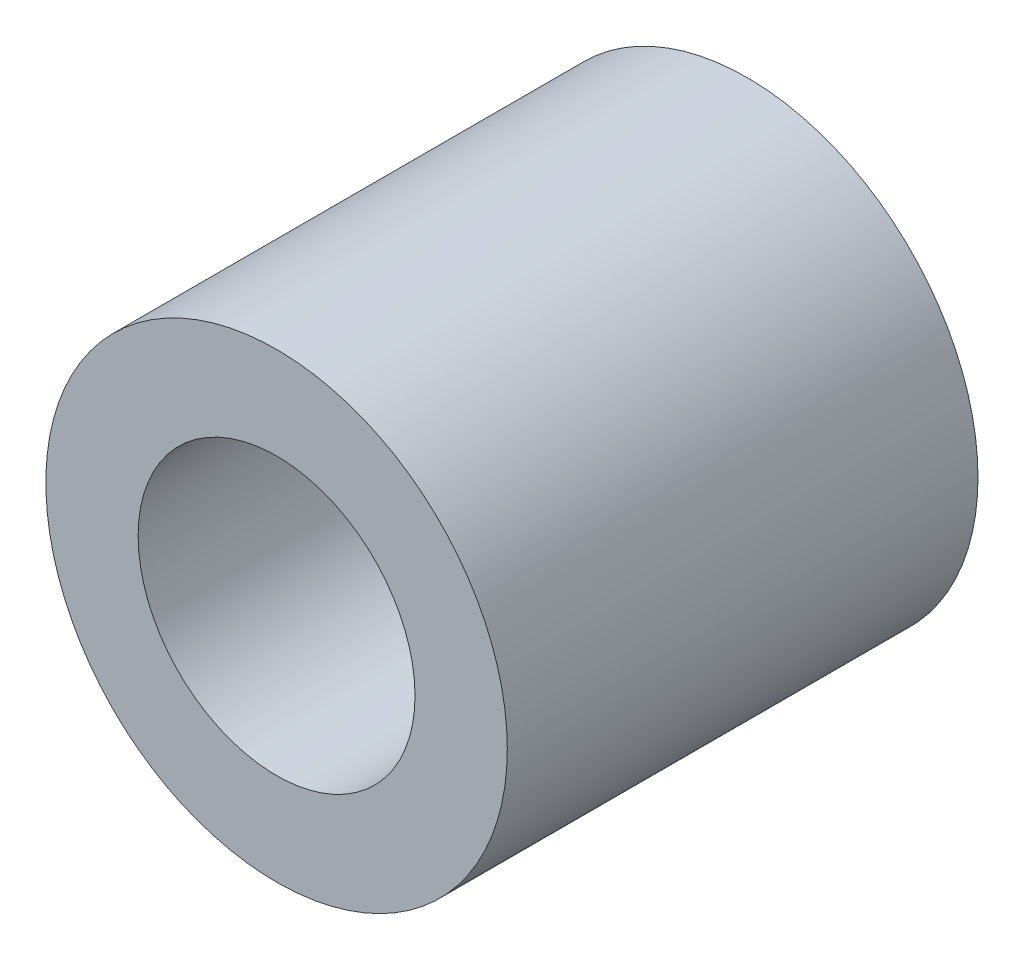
ISO-10303-21;
HEADER;
FILE_DESCRIPTION(('STEP AP214'),'2;1');
FILE_NAME('part.step','',(''),(''),'','','');
FILE_SCHEMA(('AUTOMOTIVE_DESIGN { 1 0 10303 214 1 1 1 1 }'));
ENDSEC;
DATA;
#1=APPLICATION_CONTEXT('core data for automotive mechanical design processes');
#2=APPLICATION_PROTOCOL_DEFINITION('international standard','automotive_design',2000,#1);
#3=PRODUCT_CONTEXT('',#1,'mechanical');
#4=PRODUCT('Part','Part','',(#3));
#5=PRODUCT_RELATED_PRODUCT_CATEGORY('part','',(#4));
#6=PRODUCT_DEFINITION_FORMATION('','',#4);
#7=PRODUCT_DEFINITION_CONTEXT('part definition',#1,'design');
#8=PRODUCT_DEFINITION('design','',#6,#7);
#9=PRODUCT_DEFINITION_SHAPE('','',#8);
#10=(LENGTH_UNIT() NAMED_UNIT(*) SI_UNIT(.MILLI.,.METRE.));
#11=(NAMED_UNIT(*) PLANE_ANGLE_UNIT() SI_UNIT($,.RADIAN.));
#12=(NAMED_UNIT(*) SI_UNIT($,.STERADIAN.) SOLID_ANGLE_UNIT());
#13=UNCERTAINTY_MEASURE_WITH_UNIT(LENGTH_MEASURE(1.E-05),#10,'distance_accuracy_value','');
#14=(GEOMETRIC_REPRESENTATION_CONTEXT(3) GLOBAL_UNCERTAINTY_ASSIGNED_CONTEXT((#13)) GLOBAL_UNIT_ASSIGNED_CONTEXT((#10,
#11,#12)) REPRESENTATION_CONTEXT('',''));
#15=CARTESIAN_POINT('',(0.,0.,0.));
#16=DIRECTION('',(0.,0.,1.));
#17=DIRECTION('',(1.,0.,0.));
#18=AXIS2_PLACEMENT_3D('',#15,#16,#17);
#19=CARTESIAN_POINT('',(0.,0.,5.1));
#20=DIRECTION('',(0.,0.,1.));
#21=DIRECTION('',(1.,0.,0.));
#22=AXIS2_PLACEMENT_3D('',#19,#20,#21);
#23=PLANE('',#22);
#24=CARTESIAN_POINT('',(0.,0.,5.1));
#25=DIRECTION('',(0.,0.,1.));
#26=DIRECTION('',(1.,0.,0.));
#27=AXIS2_PLACEMENT_3D('',#24,#25,#26);
#28=CIRCLE('',#27,2.5);
#29=CARTESIAN_POINT('',(2.5,0.,5.1));
#30=VERTEX_POINT('',#29);
#31=EDGE_CURVE('E10',#30,#30,#28,.T.);
#32=ORIENTED_EDGE('',*,*,#31,.T.);
#33=EDGE_LOOP('',(#32));
#34=FACE_BOUND('',#33,.T.);
#35=CARTESIAN_POINT('',(0.,0.,5.1));
#36=DIRECTION('',(0.,0.,1.));
#37=DIRECTION('',(1.,0.,0.));
#38=AXIS2_PLACEMENT_3D('',#35,#36,#37);
#39=CIRCLE('',#38,1.5);
#40=CARTESIAN_POINT('',(1.5,0.,5.1));
#41=VERTEX_POINT('',#40);
#42=EDGE_CURVE('E43',#41,#41,#39,.T.);
#43=ORIENTED_EDGE('',*,*,#42,.F.);
#44=EDGE_LOOP('',(#43));
#45=FACE_BOUND('',#44,.T.);
#46=ADVANCED_FACE('F32',(#34,#45),#23,.T.);
#47=CARTESIAN_POINT('',(0.,0.,0.));
#48=DIRECTION('',(0.,0.,1.));
#49=DIRECTION('',(1.,0.,0.));
#50=AXIS2_PLACEMENT_3D('',#47,#48,#49);
#51=PLANE('',#50);
#52=CARTESIAN_POINT('',(0.,0.,0.));
#53=DIRECTION('',(0.,0.,1.));
#54=DIRECTION('',(1.,0.,0.));
#55=AXIS2_PLACEMENT_3D('',#52,#53,#54);
#56=CIRCLE('',#55,2.5);
#57=CARTESIAN_POINT('',(2.5,0.,0.));
#58=VERTEX_POINT('',#57);
#59=EDGE_CURVE('E39',#58,#58,#56,.T.);
#60=ORIENTED_EDGE('',*,*,#59,.F.);
#61=EDGE_LOOP('',(#60));
#62=FACE_BOUND('',#61,.T.);
#63=CARTESIAN_POINT('',(0.,0.,0.));
#64=DIRECTION('',(0.,0.,1.));
#65=DIRECTION('',(1.,0.,0.));
#66=AXIS2_PLACEMENT_3D('',#63,#64,#65);
#67=CIRCLE('',#66,1.5);
#68=CARTESIAN_POINT('',(1.5,0.,0.));
#69=VERTEX_POINT('',#68);
#70=EDGE_CURVE('E47',#69,#69,#67,.T.);
#71=ORIENTED_EDGE('',*,*,#70,.T.);
#72=EDGE_LOOP('',(#71));
#73=FACE_BOUND('',#72,.T.);
#74=ADVANCED_FACE('F53',(#62,#73),#51,.F.);
#75=CARTESIAN_POINT('',(0.,0.,5.1));
#76=DIRECTION('',(0.,0.,-1.));
#77=DIRECTION('',(-1.,0.,0.));
#78=AXIS2_PLACEMENT_3D('',#75,#76,#77);
#79=CYLINDRICAL_SURFACE('',#78,2.5);
#80=ORIENTED_EDGE('',*,*,#31,.F.);
#81=EDGE_LOOP('',(#80));
#82=FACE_BOUND('',#81,.T.);
#83=ORIENTED_EDGE('',*,*,#59,.T.);
#84=EDGE_LOOP('',(#83));
#85=FACE_BOUND('',#84,.T.);
#86=ADVANCED_FACE('F34',(#82,#85),#79,.T.);
#87=CARTESIAN_POINT('',(0.,0.,5.1));
#88=DIRECTION('',(0.,0.,-1.));
#89=DIRECTION('',(-1.,0.,0.));
#90=AXIS2_PLACEMENT_3D('',#87,#88,#89);
#91=CYLINDRICAL_SURFACE('',#90,1.5);
#92=ORIENTED_EDGE('',*,*,#42,.T.);
#93=EDGE_LOOP('',(#92));
#94=FACE_BOUND('',#93,.T.);
#95=ORIENTED_EDGE('',*,*,#70,.F.);
#96=EDGE_LOOP('',(#95));
#97=FACE_BOUND('',#96,.T.);
#98=ADVANCED_FACE('F55',(#94,#97),#91,.F.);
#99=CLOSED_SHELL('',(#46,#74,#86,#98));
#100=MANIFOLD_SOLID_BREP('B2',#99);
#101=ADVANCED_BREP_SHAPE_REPRESENTATION('',(#18,#100),#14);
#102=SHAPE_DEFINITION_REPRESENTATION(#9,#101);
ENDSEC;
END-ISO-10303-21;
